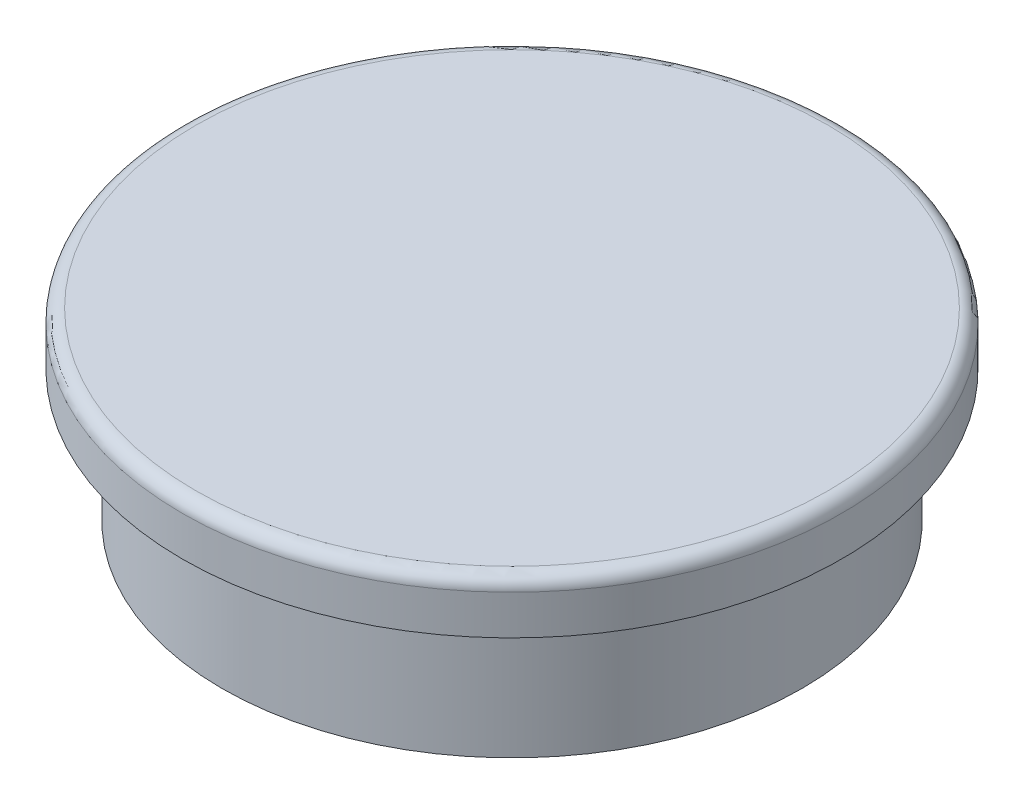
ISO-10303-21;
HEADER;
FILE_DESCRIPTION(('STEP AP214'),'2;1');
FILE_NAME('part.step','',(''),(''),'','','');
FILE_SCHEMA(('AUTOMOTIVE_DESIGN { 1 0 10303 214 1 1 1 1 }'));
ENDSEC;
DATA;
#1=APPLICATION_CONTEXT('core data for automotive mechanical design processes');
#2=APPLICATION_PROTOCOL_DEFINITION('international standard','automotive_design',2000,#1);
#3=PRODUCT_CONTEXT('',#1,'mechanical');
#4=PRODUCT('Part','Part','',(#3));
#5=PRODUCT_RELATED_PRODUCT_CATEGORY('part','',(#4));
#6=PRODUCT_DEFINITION_FORMATION('','',#4);
#7=PRODUCT_DEFINITION_CONTEXT('part definition',#1,'design');
#8=PRODUCT_DEFINITION('design','',#6,#7);
#9=PRODUCT_DEFINITION_SHAPE('','',#8);
#10=(LENGTH_UNIT() NAMED_UNIT(*) SI_UNIT(.MILLI.,.METRE.));
#11=(NAMED_UNIT(*) PLANE_ANGLE_UNIT() SI_UNIT($,.RADIAN.));
#12=(NAMED_UNIT(*) SI_UNIT($,.STERADIAN.) SOLID_ANGLE_UNIT());
#13=UNCERTAINTY_MEASURE_WITH_UNIT(LENGTH_MEASURE(1.E-05),#10,'distance_accuracy_value','');
#14=(GEOMETRIC_REPRESENTATION_CONTEXT(3) GLOBAL_UNCERTAINTY_ASSIGNED_CONTEXT((#13)) GLOBAL_UNIT_ASSIGNED_CONTEXT((#10,
#11,#12)) REPRESENTATION_CONTEXT('',''));
#15=CARTESIAN_POINT('',(0.,0.,0.));
#16=DIRECTION('',(0.,0.,1.));
#17=DIRECTION('',(1.,0.,0.));
#18=AXIS2_PLACEMENT_3D('',#15,#16,#17);
#19=CARTESIAN_POINT('',(0.,5.,0.));
#20=DIRECTION('',(0.,-1.,0.));
#21=DIRECTION('',(0.,0.,-1.));
#22=AXIS2_PLACEMENT_3D('',#19,#20,#21);
#23=CYLINDRICAL_SURFACE('',#22,11.);
#24=CARTESIAN_POINT('',(0.,5.,0.));
#25=DIRECTION('',(0.,1.,0.));
#26=DIRECTION('',(0.,0.,1.));
#27=AXIS2_PLACEMENT_3D('',#24,#25,#26);
#28=CIRCLE('',#27,11.);
#29=CARTESIAN_POINT('',(0.,5.,11.));
#30=VERTEX_POINT('',#29);
#31=EDGE_CURVE('E44',#30,#30,#28,.T.);
#32=ORIENTED_EDGE('',*,*,#31,.F.);
#33=EDGE_LOOP('',(#32));
#34=FACE_BOUND('',#33,.T.);
#35=CARTESIAN_POINT('',(0.,0.,0.));
#36=DIRECTION('',(0.,1.,0.));
#37=DIRECTION('',(0.,0.,1.));
#38=AXIS2_PLACEMENT_3D('',#35,#36,#37);
#39=CIRCLE('',#38,11.);
#40=CARTESIAN_POINT('',(0.,0.,11.));
#41=VERTEX_POINT('',#40);
#42=EDGE_CURVE('E48',#41,#41,#39,.T.);
#43=ORIENTED_EDGE('',*,*,#42,.T.);
#44=EDGE_LOOP('',(#43));
#45=FACE_BOUND('',#44,.T.);
#46=ADVANCED_FACE('F33',(#34,#45),#23,.T.);
#47=CARTESIAN_POINT('',(0.,0.,0.));
#48=DIRECTION('',(0.,1.,0.));
#49=DIRECTION('',(0.,0.,1.));
#50=AXIS2_PLACEMENT_3D('',#47,#48,#49);
#51=PLANE('',#50);
#52=ORIENTED_EDGE('',*,*,#42,.F.);
#53=EDGE_LOOP('',(#52));
#54=FACE_BOUND('',#53,.T.);
#55=ADVANCED_FACE('F72',(#54),#51,.F.);
#56=CARTESIAN_POINT('',(0.,7.,0.));
#57=DIRECTION('',(0.,-1.,0.));
#58=DIRECTION('',(0.,0.,-1.));
#59=AXIS2_PLACEMENT_3D('',#56,#57,#58);
#60=CYLINDRICAL_SURFACE('',#59,12.5);
#61=CARTESIAN_POINT('',(0.,6.5,0.));
#62=DIRECTION('',(0.,1.,0.));
#63=DIRECTION('',(0.,0.,1.));
#64=AXIS2_PLACEMENT_3D('',#61,#62,#63);
#65=CIRCLE('',#64,12.5);
#66=CARTESIAN_POINT('',(0.,6.5,12.5));
#67=VERTEX_POINT('',#66);
#68=EDGE_CURVE('E10',#67,#67,#65,.F.);
#69=ORIENTED_EDGE('',*,*,#68,.T.);
#70=EDGE_LOOP('',(#69));
#71=FACE_BOUND('',#70,.T.);
#72=CARTESIAN_POINT('',(0.,5.,0.));
#73=DIRECTION('',(0.,1.,0.));
#74=DIRECTION('',(0.,0.,1.));
#75=AXIS2_PLACEMENT_3D('',#72,#73,#74);
#76=CIRCLE('',#75,12.5);
#77=CARTESIAN_POINT('',(0.,5.,12.5));
#78=VERTEX_POINT('',#77);
#79=EDGE_CURVE('E52',#78,#78,#76,.T.);
#80=ORIENTED_EDGE('',*,*,#79,.T.);
#81=EDGE_LOOP('',(#80));
#82=FACE_BOUND('',#81,.T.);
#83=ADVANCED_FACE('F57',(#71,#82),#60,.T.);
#84=CARTESIAN_POINT('',(0.,7.,0.));
#85=DIRECTION('',(0.,1.,0.));
#86=DIRECTION('',(0.,0.,1.));
#87=AXIS2_PLACEMENT_3D('',#84,#85,#86);
#88=PLANE('',#87);
#89=CARTESIAN_POINT('',(0.,7.,0.));
#90=DIRECTION('',(0.,1.,0.));
#91=DIRECTION('',(0.,0.,1.));
#92=AXIS2_PLACEMENT_3D('',#89,#90,#91);
#93=CIRCLE('',#92,12.);
#94=CARTESIAN_POINT('',(0.,7.,12.));
#95=VERTEX_POINT('',#94);
#96=EDGE_CURVE('E40',#95,#95,#93,.T.);
#97=ORIENTED_EDGE('',*,*,#96,.T.);
#98=EDGE_LOOP('',(#97));
#99=FACE_BOUND('',#98,.T.);
#100=ADVANCED_FACE('F61',(#99),#88,.T.);
#101=CARTESIAN_POINT('',(0.,5.,0.));
#102=DIRECTION('',(0.,1.,0.));
#103=DIRECTION('',(0.,0.,1.));
#104=AXIS2_PLACEMENT_3D('',#101,#102,#103);
#105=PLANE('',#104);
#106=ORIENTED_EDGE('',*,*,#31,.T.);
#107=EDGE_LOOP('',(#106));
#108=FACE_BOUND('',#107,.T.);
#109=ORIENTED_EDGE('',*,*,#79,.F.);
#110=EDGE_LOOP('',(#109));
#111=FACE_BOUND('',#110,.T.);
#112=ADVANCED_FACE('F59',(#108,#111),#105,.F.);
#113=CARTESIAN_POINT('',(0.,6.5,0.));
#114=DIRECTION('',(0.,1.,0.));
#115=DIRECTION('',(0.,0.,1.));
#116=AXIS2_PLACEMENT_3D('',#113,#114,#115);
#117=TOROIDAL_SURFACE('',#116,12.,0.5);
#118=ORIENTED_EDGE('',*,*,#68,.F.);
#119=EDGE_LOOP('',(#118));
#120=FACE_BOUND('',#119,.T.);
#121=ORIENTED_EDGE('',*,*,#96,.F.);
#122=EDGE_LOOP('',(#121));
#123=FACE_BOUND('',#122,.T.);
#124=ADVANCED_FACE('F35',(#120,#123),#117,.T.);
#125=CLOSED_SHELL('',(#46,#55,#83,#100,#112,#124));
#126=MANIFOLD_SOLID_BREP('B2',#125);
#127=ADVANCED_BREP_SHAPE_REPRESENTATION('',(#18,#126),#14);
#128=SHAPE_DEFINITION_REPRESENTATION(#9,#127);
ENDSEC;
END-ISO-10303-21;
